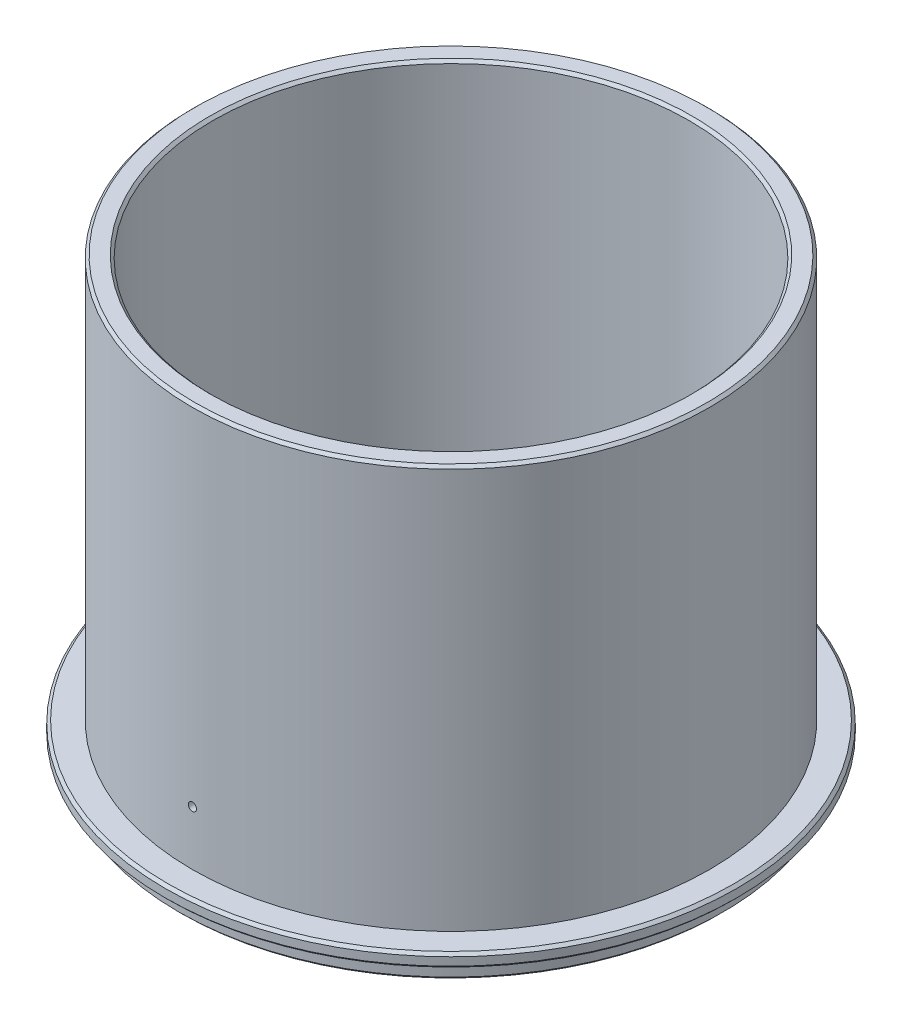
from build123d import *

# Parameters (mm, degrees)
F_3_0_3_DIAMETER_HOLE1_REACH  = 261.632
F_3_0_3_DIAMETER_HOLE1_BORE_R = 1.5
CHAMFER1_SIZE                 = 1
CHAMFER2_SIZE                 = 1


with BuildPart() as part:
    # Sketch1 → Revolve1 (revolve)
    with BuildSketch(Plane(origin=(0, 0, 0), x_dir=(0, 0, -1), z_dir=(1, 0, 0))):
        Polygon((87.5, 0), (100, 0), (100, 7), (105, 7), (105, 12), (95, 12), (95, 160), (87.5, 160), align=None)
    revolve(axis=Axis((0, 0, 0), (0, 1, 0)))

    # 3.0 _3_ Diameter Hole1 bore (on position points) → 3.0 _3_ Diameter Hole1 (cut, up to next)
    with BuildSketch(Plane(origin=(0, 32, 95), x_dir=(1, 0, 0), z_dir=(0, 0, 1)), mode=Mode.PRIVATE) as f_3_0_3_diameter_hole1_sk1:
        Circle(F_3_0_3_DIAMETER_HOLE1_BORE_R)
    f_3_0_3_diameter_hole1_tool1 = extrude(f_3_0_3_diameter_hole1_sk1.sketch, amount=-F_3_0_3_DIAMETER_HOLE1_REACH, mode=Mode.PRIVATE) & part.part
    add(f_3_0_3_diameter_hole1_tool1.solids().sort_by_distance((0, 32, 95))[0], mode=Mode.SUBTRACT)

    # Chamfer1
    chamfer1_edges = [part.edges().sort_by_distance(p)[0] for p in [
        (0, 160, 95),
        (0, 160, 87.5),
    ]]
    chamfer(chamfer1_edges, length=CHAMFER1_SIZE)

    # Chamfer2
    chamfer2_edges = [part.edges().sort_by_distance(p)[0] for p in [
        (0, 7, 105),
        (0, 12, 105),
        (0, 0, 100),
    ]]
    chamfer(chamfer2_edges, length=CHAMFER2_SIZE)


solid = part.part
